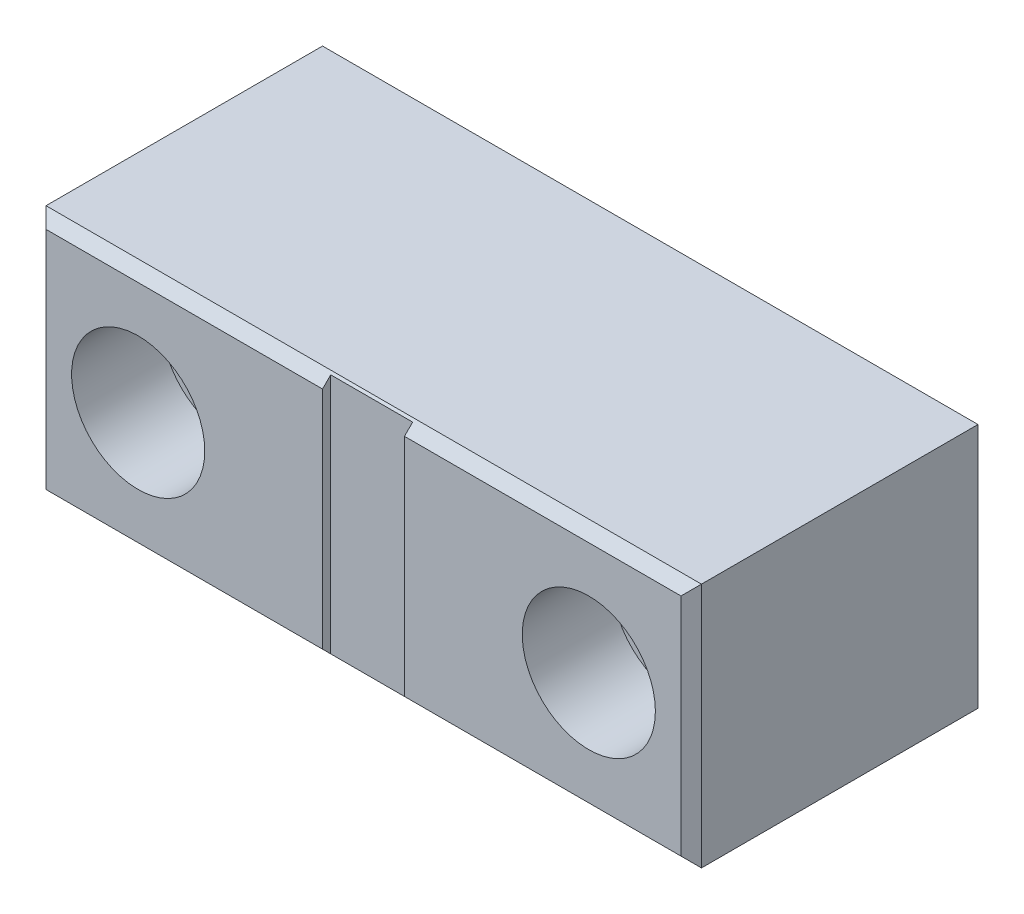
from build123d import *

# Parameters (mm, degrees)
SKETCH1_W                                        = 101.6
SKETCH1_H                                        = 38.1
BOSS_EXTRUDE1_DEPTH                              = 44.45
CBORE_FOR_1_2_SOCKET_HEAD_CAP_SCREW1_D           = 13.49248
CBORE_FOR_1_2_SOCKET_HEAD_CAP_SCREW1_CBORE_D     = 20.6375
CBORE_FOR_1_2_SOCKET_HEAD_CAP_SCREW1_CBORE_DEPTH = 13.97
CHAMFER1_SIZE                                    = 1.5875
SKETCH2_W                                        = 12.7
SKETCH2_H                                        = 38.1
CUT_EXTRUDE1_DEPTH                               = 1.27
CUT_EXTRUDE2_DEPTH                               = 0.127


with BuildPart() as part:
    # Sketch1 → Boss-Extrude1 (new body)
    with BuildSketch(Plane.XY.offset(-44.45)):
        with Locations((-838.2, -241.3)):
            Rectangle(SKETCH1_W, SKETCH1_H)
    extrude(amount=BOSS_EXTRUDE1_DEPTH)

    # CBORE for 1_2 Socket Head Cap Screw1 (through all)
    with Locations(Plane.XY):
        with Locations((-873.125, -241.3), (-803.275, -241.3)):
            CounterBoreHole(CBORE_FOR_1_2_SOCKET_HEAD_CAP_SCREW1_D / 2, CBORE_FOR_1_2_SOCKET_HEAD_CAP_SCREW1_CBORE_D / 2, CBORE_FOR_1_2_SOCKET_HEAD_CAP_SCREW1_CBORE_DEPTH)

    # Chamfer1
    chamfer1_edges = [part.edges().sort_by_distance(p)[0] for p in [
        (-787.4, -241.3, 0),
        (-838.2, -222.25, 0),
        (-889, -241.3, 0),
        (-838.2, -260.35, 0),
    ]]
    chamfer(chamfer1_edges, length=CHAMFER1_SIZE)

    # Sketch2 → Cut-Extrude1 (cut)
    with BuildSketch(Plane.XY):
        with Locations((-838.2, -241.3)):
            Rectangle(SKETCH2_W, SKETCH2_H)
    extrude(amount=-CUT_EXTRUDE1_DEPTH, mode=Mode.SUBTRACT)

    # Sketch3 → Cut-Extrude2 (cut)
    # profile 1 of 4: a face of its own
    with BuildSketch(Plane.XZ.offset(260.35)):
        with BuildLine():
            add(Edge.make_bspline(
                [(-842.331570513, -17.463772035), (-842.331272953, -17.412883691), (-842.33069494, -17.314032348), (-842.32426473, -17.169991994), (-842.313582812, -17.034863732), (-842.29894391, -16.908641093), (-842.281129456, -16.791291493), (-842.257348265, -16.683128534), (-842.230303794, -16.583651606), (-842.198959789, -16.492536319), (-842.163592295, -16.408555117), (-842.125098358, -16.330155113), (-842.081950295, -16.257454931), (-842.036614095, -16.189294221), (-841.987254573, -16.126788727), (-841.935276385, -16.06905574), (-841.878650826, -16.017429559), (-841.819302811, -15.970397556), (-841.756695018, -15.929168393), (-841.692612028, -15.89285298), (-841.626612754, -15.861828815), (-841.558517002, -15.837435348), (-841.488936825, -15.817286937), (-841.417628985, -15.803508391), (-841.344475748, -15.79483891), (-841.295098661, -15.794010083), (-841.270057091, -15.793589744)],
                knots=[0, 0, 0, 0, 1.646270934, 3.197905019, 4.663502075, 6.030701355, 7.308322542, 8.50163776, 9.611534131, 10.641858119, 11.616356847, 12.558055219, 13.465016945, 14.349605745, 15.204443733, 16.039544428, 16.859896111, 17.680448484, 18.487036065, 19.28249412, 20.06191084, 20.843045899, 21.620316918, 22.403196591, 23.190181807, 24, 24, 24, 24], degree=3))
            add(Edge.make_bspline(
                [(-841.270057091, -15.793589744), (-841.244806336, -15.794032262), (-841.194590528, -15.794912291), (-841.120349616, -15.803370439), (-841.047823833, -15.817404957), (-840.977322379, -15.837290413), (-840.908266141, -15.861960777), (-840.841195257, -15.892882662), (-840.775693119, -15.928877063), (-840.712800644, -15.97117158), (-840.651827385, -16.018326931), (-840.594271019, -16.071633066), (-840.540126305, -16.13055174), (-840.488713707, -16.194452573), (-840.441491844, -16.264561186), (-840.396521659, -16.3396582), (-840.356269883, -16.421056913), (-840.317503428, -16.507399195), (-840.284041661, -16.601074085), (-840.253864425, -16.701553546), (-840.22948136, -16.810024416), (-840.209171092, -16.925917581), (-840.193436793, -17.049658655), (-840.181977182, -17.180982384), (-840.175923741, -17.319975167), (-840.174783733, -17.415005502), (-840.174198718, -17.463772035)],
                knots=[0, 0, 0, 0, 0.810914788, 1.612654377, 2.396697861, 3.181598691, 3.963628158, 4.749916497, 5.551656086, 6.361998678, 7.18212741, 8.025565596, 8.878627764, 9.750805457, 10.657531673, 11.591944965, 12.560506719, 13.57287815, 14.630710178, 15.753379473, 16.941251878, 18.199788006, 19.531962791, 20.947069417, 22.433333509, 24, 24, 24, 24], degree=3))
            add(Edge.make_bspline(
                [(-840.174198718, -17.463772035), (-840.174789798, -17.512325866), (-840.175941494, -17.606931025), (-840.181909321, -17.74529841), (-840.193664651, -17.875925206), (-840.208369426, -17.999124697), (-840.228735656, -18.114384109), (-840.253777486, -18.222102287), (-840.281581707, -18.322744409), (-840.31590327, -18.415485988), (-840.353468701, -18.501620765), (-840.3943402, -18.582054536), (-840.438127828, -18.657498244), (-840.485833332, -18.727348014), (-840.536681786, -18.792098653), (-840.591761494, -18.850607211), (-840.649519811, -18.904283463), (-840.710672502, -18.952046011), (-840.774545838, -18.993851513), (-840.839823, -19.031238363), (-840.907662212, -19.061385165), (-840.976526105, -19.087270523), (-841.047399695, -19.107046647), (-841.120194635, -19.120720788), (-841.194540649, -19.130310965), (-841.244797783, -19.131042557), (-841.270057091, -19.131410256)],
                knots=[0, 0, 0, 0, 1.561518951, 3.042555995, 4.452378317, 5.7783523, 7.031515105, 8.214008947, 9.334062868, 10.386615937, 11.391082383, 12.354592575, 13.286541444, 14.194233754, 15.072674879, 15.931287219, 16.775624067, 17.606195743, 18.42308326, 19.229000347, 20.022332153, 20.807536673, 21.593273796, 22.3848459, 23.188221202, 24, 24, 24, 24], degree=3))
            add(Edge.make_bspline(
                [(-841.270057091, -19.131410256), (-841.295097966, -19.130987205), (-841.344473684, -19.130153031), (-841.417636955, -19.121522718), (-841.488650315, -19.107647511), (-841.557864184, -19.088219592), (-841.625633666, -19.06443899), (-841.691035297, -19.03345672), (-841.754796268, -18.997775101), (-841.816746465, -18.957139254), (-841.875721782, -18.910583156), (-841.932054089, -18.859089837), (-841.984328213, -18.801374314), (-842.032982, -18.738347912), (-842.07922278, -18.670590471), (-842.12175814, -18.597176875), (-842.1611017, -18.518398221), (-842.19706401, -18.433745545), (-842.228948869, -18.341983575), (-842.257113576, -18.242062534), (-842.279351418, -18.133100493), (-842.298385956, -18.015972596), (-842.31373879, -17.89017553), (-842.324220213, -17.755641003), (-842.330698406, -17.612452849), (-842.331274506, -17.514236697), (-842.331570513, -17.463772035)],
                knots=[0, 0, 0, 0, 0.810891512, 1.598919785, 2.382837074, 3.152667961, 3.926044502, 4.706494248, 5.493654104, 6.291793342, 7.103789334, 7.925228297, 8.761435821, 9.622817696, 10.50288917, 11.416980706, 12.369136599, 13.353924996, 14.394355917, 15.514179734, 16.714354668, 17.994756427, 19.357759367, 20.818452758, 22.365282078, 24, 24, 24, 24], degree=3))
        make_face()
        with BuildLine():
            add(Edge.make_bspline(
                [(-842.046634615, -17.4625), (-842.04652626, -17.504907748), (-842.046315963, -17.58721286), (-842.040822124, -17.706813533), (-842.033337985, -17.818365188), (-842.023684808, -17.922009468), (-842.009349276, -18.01739555), (-841.99328669, -18.105179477), (-841.973739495, -18.184896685), (-841.950611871, -18.257094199), (-841.924269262, -18.322997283), (-841.895507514, -18.384321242), (-841.864609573, -18.441790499), (-841.830030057, -18.494888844), (-841.792369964, -18.543789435), (-841.752479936, -18.58935779), (-841.708871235, -18.629995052), (-841.64854284, -18.678732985), (-841.568898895, -18.72909677), (-841.46855034, -18.77295358), (-841.365436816, -18.800514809), (-841.295449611, -18.804019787), (-841.260516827, -18.805769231)],
                knots=[0, 0, 0, 0, 1.459021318, 2.831673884, 4.118529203, 5.306027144, 6.411944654, 7.436330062, 8.375795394, 9.233974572, 10.042671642, 10.816086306, 11.563610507, 12.285937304, 12.993564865, 13.685989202, 14.367179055, 15.041617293, 16.353048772, 17.594441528, 18.799311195, 20, 20, 20, 20], degree=3))
            add(Edge.make_bspline(
                [(-841.260516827, -18.805769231), (-841.225358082, -18.804319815), (-841.155113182, -18.801423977), (-841.052484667, -18.773485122), (-840.952852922, -18.731330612), (-840.874773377, -18.681485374), (-840.815371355, -18.634016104), (-840.772810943, -18.593544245), (-840.733747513, -18.548227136), (-840.696697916, -18.499332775), (-840.662717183, -18.445927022), (-840.631817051, -18.388266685), (-840.603620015, -18.326191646), (-840.58755538, -18.282857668), (-840.579341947, -18.260702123)],
                knots=[0, 0, 0, 0, 1.353760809, 2.704726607, 4.075137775, 5.516104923, 6.260822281, 7.007110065, 7.778089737, 8.566572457, 9.372053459, 10.217411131, 11.088608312, 12, 12, 12, 12], degree=3))
            add(Edge.make_bspline(
                [(-840.579341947, -18.260702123), (-840.569769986, -18.232372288), (-840.550334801, -18.174850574), (-840.525286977, -18.085620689), (-840.505560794, -17.992001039), (-840.487814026, -17.894551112), (-840.475700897, -17.79255224), (-840.465951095, -17.68632002), (-840.460208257, -17.575774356), (-840.459496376, -17.500667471), (-840.459134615, -17.4625)],
                knots=[0, 0, 0, 0, 0.884706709, 1.796334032, 2.740027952, 3.714592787, 4.726048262, 5.777819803, 6.87074269, 8, 8, 8, 8], degree=3))
            add(Edge.make_bspline(
                [(-840.459134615, -17.4625), (-840.459633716, -17.424338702), (-840.460610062, -17.349687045), (-840.464342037, -17.240359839), (-840.473979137, -17.136521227), (-840.484682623, -17.03772387), (-840.500464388, -16.944514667), (-840.517480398, -16.856113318), (-840.540341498, -16.773615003), (-840.56476158, -16.695728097), (-840.59271101, -16.623337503), (-840.623477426, -16.556105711), (-840.656335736, -16.493708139), (-840.692024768, -16.436315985), (-840.730120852, -16.383672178), (-840.771629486, -16.336832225), (-840.814904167, -16.294344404), (-840.8755169, -16.245846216), (-840.954868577, -16.196396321), (-841.053607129, -16.15088881), (-841.156359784, -16.124755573), (-841.225822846, -16.121071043), (-841.260516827, -16.119230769)],
                knots=[0, 0, 0, 0, 1.31362396, 2.569729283, 3.763502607, 4.902122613, 5.988968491, 7.01645872, 7.998833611, 8.933434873, 9.825090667, 10.667526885, 11.477055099, 12.250526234, 12.991942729, 13.710640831, 14.402115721, 15.076753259, 16.378508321, 17.609869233, 18.806226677, 20, 20, 20, 20], degree=3))
            add(Edge.make_bspline(
                [(-841.260516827, -16.119230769), (-841.295632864, -16.121073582), (-841.365928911, -16.124762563), (-841.469749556, -16.150791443), (-841.569267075, -16.196160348), (-841.648408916, -16.24601), (-841.709063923, -16.293488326), (-841.751774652, -16.334660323), (-841.791821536, -16.379696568), (-841.82871295, -16.429046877), (-841.863265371, -16.482083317), (-841.894998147, -16.539223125), (-841.923588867, -16.600755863), (-841.949972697, -16.666629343), (-841.973170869, -16.738820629), (-841.992306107, -16.818439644), (-842.009983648, -16.905944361), (-842.022497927, -17.001847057), (-842.033622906, -17.105517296), (-842.040772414, -17.217347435), (-842.046334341, -17.337148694), (-842.046532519, -17.419879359), (-842.046634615, -17.4625)],
                knots=[0, 0, 0, 0, 1.207732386, 2.417664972, 3.655092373, 4.956220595, 5.625982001, 6.301752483, 6.994047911, 7.697131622, 8.419323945, 9.170223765, 9.943494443, 10.752040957, 11.610060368, 12.549350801, 13.567764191, 14.679664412, 15.874934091, 17.154273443, 18.533957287, 20, 20, 20, 20], degree=3))
        make_face(mode=Mode.SUBTRACT)
    # profile 2 of 4: a face of its own
    with BuildSketch(Plane.XZ.offset(260.35)):
        with BuildLine():
            add(Edge.make_bspline(
                [(-839.380448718, -18.561538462), (-839.362768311, -18.562589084), (-839.328107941, -18.564648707), (-839.27799816, -18.578778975), (-839.232645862, -18.603869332), (-839.192248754, -18.637309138), (-839.158950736, -18.677854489), (-839.132966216, -18.722845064), (-839.118959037, -18.773374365), (-839.116914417, -18.808235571), (-839.115865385, -18.826121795)],
                knots=[0, 0, 0, 0, 1.020151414, 1.999887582, 2.974338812, 3.990962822, 5.007586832, 5.987933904, 6.967670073, 8, 8, 8, 8], degree=3))
            add(Edge.make_bspline(
                [(-839.115865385, -18.826121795), (-839.116949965, -18.843578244), (-839.119088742, -18.878002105), (-839.132934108, -18.928150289), (-839.159148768, -18.973168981), (-839.192019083, -19.014264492), (-839.232655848, -19.047775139), (-839.27810538, -19.07265203), (-839.327990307, -19.087794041), (-839.362748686, -19.089722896), (-839.380448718, -19.090705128)],
                knots=[0, 0, 0, 0, 1.009421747, 1.99056486, 2.972319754, 3.999869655, 5.017953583, 5.993804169, 6.978383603, 8, 8, 8, 8], degree=3))
            add(Edge.make_bspline(
                [(-839.380448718, -19.090705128), (-839.398161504, -19.089758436), (-839.432741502, -19.087910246), (-839.482440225, -19.072341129), (-839.528166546, -19.048008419), (-839.568795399, -19.014202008), (-839.601941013, -18.973380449), (-839.627001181, -18.927840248), (-839.642050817, -18.878145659), (-839.644030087, -18.843606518), (-839.645032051, -18.826121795)],
                knots=[0, 0, 0, 0, 1.022052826, 1.995314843, 2.982371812, 4.00089066, 5.028879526, 6.005146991, 6.990147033, 8, 8, 8, 8], degree=3))
            add(Edge.make_bspline(
                [(-839.645032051, -18.826121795), (-839.644068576, -18.808206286), (-839.642187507, -18.773228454), (-839.626969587, -18.723154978), (-839.602135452, -18.677645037), (-839.568566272, -18.637370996), (-839.528176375, -18.6036368), (-839.482550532, -18.579085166), (-839.432621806, -18.564534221), (-839.398141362, -18.562554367), (-839.380448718, -18.561538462)],
                knots=[0, 0, 0, 0, 1.032775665, 2.016367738, 2.991239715, 4.008302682, 5.025365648, 6.011011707, 6.979408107, 8, 8, 8, 8], degree=3))
        make_face()
    # profile 3 of 4: a face of its own
    with BuildSketch(Plane.XZ.offset(260.35)):
        with BuildLine():
            add(Edge.make_bspline(
                [(-838.708814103, -17.463772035), (-838.708516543, -17.412883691), (-838.70793853, -17.314032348), (-838.70150832, -17.169991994), (-838.690826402, -17.034863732), (-838.676187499, -16.908641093), (-838.658373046, -16.791291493), (-838.634591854, -16.683128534), (-838.607547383, -16.583651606), (-838.576203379, -16.492536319), (-838.540835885, -16.408555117), (-838.502341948, -16.330155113), (-838.459193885, -16.257454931), (-838.413857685, -16.189294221), (-838.364498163, -16.126788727), (-838.312519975, -16.06905574), (-838.255894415, -16.017429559), (-838.196546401, -15.970397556), (-838.133938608, -15.929168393), (-838.069855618, -15.89285298), (-838.003856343, -15.861828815), (-837.935760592, -15.837435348), (-837.866180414, -15.817286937), (-837.794872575, -15.803508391), (-837.721719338, -15.79483891), (-837.672342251, -15.794010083), (-837.647300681, -15.793589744)],
                knots=[0, 0, 0, 0, 1.646270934, 3.197905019, 4.663502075, 6.030701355, 7.308322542, 8.50163776, 9.611534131, 10.641858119, 11.616356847, 12.558055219, 13.465016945, 14.349605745, 15.204443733, 16.039544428, 16.859896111, 17.680448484, 18.487036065, 19.28249412, 20.06191084, 20.843045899, 21.620316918, 22.403196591, 23.190181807, 24, 24, 24, 24], degree=3))
            add(Edge.make_bspline(
                [(-837.647300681, -15.793589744), (-837.622049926, -15.794032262), (-837.571834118, -15.794912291), (-837.497593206, -15.803370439), (-837.425067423, -15.817404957), (-837.354565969, -15.837290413), (-837.285509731, -15.861960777), (-837.218438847, -15.892882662), (-837.152936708, -15.928877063), (-837.090044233, -15.97117158), (-837.029070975, -16.018326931), (-836.971514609, -16.071633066), (-836.917369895, -16.13055174), (-836.865957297, -16.194452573), (-836.818735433, -16.264561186), (-836.773765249, -16.3396582), (-836.733513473, -16.421056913), (-836.694747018, -16.507399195), (-836.661285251, -16.601074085), (-836.631108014, -16.701553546), (-836.60672495, -16.810024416), (-836.586414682, -16.925917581), (-836.570680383, -17.049658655), (-836.559220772, -17.180982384), (-836.553167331, -17.319975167), (-836.552027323, -17.415005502), (-836.551442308, -17.463772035)],
                knots=[0, 0, 0, 0, 0.810914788, 1.612654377, 2.396697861, 3.181598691, 3.963628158, 4.749916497, 5.551656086, 6.361998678, 7.18212741, 8.025565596, 8.878627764, 9.750805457, 10.657531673, 11.591944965, 12.560506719, 13.57287815, 14.630710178, 15.753379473, 16.941251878, 18.199788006, 19.531962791, 20.947069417, 22.433333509, 24, 24, 24, 24], degree=3))
            add(Edge.make_bspline(
                [(-836.551442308, -17.463772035), (-836.552033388, -17.512325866), (-836.553185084, -17.606931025), (-836.559152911, -17.74529841), (-836.57090824, -17.875925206), (-836.585613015, -17.999124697), (-836.605979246, -18.114384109), (-836.631021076, -18.222102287), (-836.658825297, -18.322744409), (-836.69314686, -18.415485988), (-836.73071229, -18.501620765), (-836.77158379, -18.582054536), (-836.815371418, -18.657498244), (-836.863076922, -18.727348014), (-836.913925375, -18.792098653), (-836.969005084, -18.850607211), (-837.0267634, -18.904283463), (-837.087916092, -18.952046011), (-837.151789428, -18.993851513), (-837.21706659, -19.031238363), (-837.284905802, -19.061385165), (-837.353769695, -19.087270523), (-837.424643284, -19.107046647), (-837.497438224, -19.120720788), (-837.571784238, -19.130310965), (-837.622041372, -19.131042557), (-837.647300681, -19.131410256)],
                knots=[0, 0, 0, 0, 1.561518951, 3.042555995, 4.452378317, 5.7783523, 7.031515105, 8.214008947, 9.334062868, 10.386615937, 11.391082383, 12.354592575, 13.286541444, 14.194233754, 15.072674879, 15.931287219, 16.775624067, 17.606195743, 18.42308326, 19.229000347, 20.022332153, 20.807536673, 21.593273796, 22.3848459, 23.188221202, 24, 24, 24, 24], degree=3))
            add(Edge.make_bspline(
                [(-837.647300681, -19.131410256), (-837.672341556, -19.130987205), (-837.721717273, -19.130153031), (-837.794880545, -19.121522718), (-837.865893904, -19.107647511), (-837.935107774, -19.088219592), (-838.002877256, -19.06443899), (-838.068278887, -19.03345672), (-838.132039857, -18.997775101), (-838.193990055, -18.957139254), (-838.252965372, -18.910583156), (-838.309297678, -18.859089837), (-838.361571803, -18.801374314), (-838.41022559, -18.738347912), (-838.45646637, -18.670590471), (-838.49900173, -18.597176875), (-838.53834529, -18.518398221), (-838.5743076, -18.433745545), (-838.606192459, -18.341983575), (-838.634357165, -18.242062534), (-838.656595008, -18.133100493), (-838.675629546, -18.015972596), (-838.690982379, -17.89017553), (-838.701463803, -17.755641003), (-838.707941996, -17.612452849), (-838.708518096, -17.514236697), (-838.708814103, -17.463772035)],
                knots=[0, 0, 0, 0, 0.810891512, 1.598919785, 2.382837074, 3.152667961, 3.926044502, 4.706494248, 5.493654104, 6.291793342, 7.103789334, 7.925228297, 8.761435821, 9.622817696, 10.50288917, 11.416980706, 12.369136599, 13.353924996, 14.394355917, 15.514179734, 16.714354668, 17.994756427, 19.357759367, 20.818452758, 22.365282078, 24, 24, 24, 24], degree=3))
        make_face()
        with BuildLine():
            add(Edge.make_bspline(
                [(-838.423878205, -17.4625), (-838.42376985, -17.504907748), (-838.423559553, -17.58721286), (-838.418065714, -17.706813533), (-838.410581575, -17.818365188), (-838.400928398, -17.922009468), (-838.386592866, -18.01739555), (-838.37053028, -18.105179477), (-838.350983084, -18.184896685), (-838.327855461, -18.257094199), (-838.301512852, -18.322997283), (-838.272751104, -18.384321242), (-838.241853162, -18.441790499), (-838.207273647, -18.494888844), (-838.169613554, -18.543789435), (-838.129723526, -18.58935779), (-838.086114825, -18.629995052), (-838.02578643, -18.678732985), (-837.946142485, -18.72909677), (-837.845793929, -18.77295358), (-837.742680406, -18.800514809), (-837.6726932, -18.804019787), (-837.637760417, -18.805769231)],
                knots=[0, 0, 0, 0, 1.459021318, 2.831673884, 4.118529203, 5.306027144, 6.411944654, 7.436330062, 8.375795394, 9.233974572, 10.042671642, 10.816086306, 11.563610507, 12.285937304, 12.993564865, 13.685989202, 14.367179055, 15.041617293, 16.353048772, 17.594441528, 18.799311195, 20, 20, 20, 20], degree=3))
            add(Edge.make_bspline(
                [(-837.637760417, -18.805769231), (-837.602601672, -18.804319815), (-837.532356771, -18.801423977), (-837.429728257, -18.773485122), (-837.330096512, -18.731330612), (-837.252016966, -18.681485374), (-837.192614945, -18.634016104), (-837.150054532, -18.593544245), (-837.110991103, -18.548227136), (-837.073941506, -18.499332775), (-837.039960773, -18.445927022), (-837.009060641, -18.388266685), (-836.980863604, -18.326191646), (-836.96479897, -18.282857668), (-836.956585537, -18.260702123)],
                knots=[0, 0, 0, 0, 1.353760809, 2.704726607, 4.075137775, 5.516104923, 6.260822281, 7.007110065, 7.778089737, 8.566572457, 9.372053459, 10.217411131, 11.088608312, 12, 12, 12, 12], degree=3))
            add(Edge.make_bspline(
                [(-836.956585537, -18.260702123), (-836.947013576, -18.232372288), (-836.927578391, -18.174850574), (-836.902530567, -18.085620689), (-836.882804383, -17.992001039), (-836.865057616, -17.894551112), (-836.852944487, -17.79255224), (-836.843194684, -17.68632002), (-836.837451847, -17.575774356), (-836.836739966, -17.500667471), (-836.836378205, -17.4625)],
                knots=[0, 0, 0, 0, 0.884706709, 1.796334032, 2.740027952, 3.714592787, 4.726048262, 5.777819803, 6.87074269, 8, 8, 8, 8], degree=3))
            add(Edge.make_bspline(
                [(-836.836378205, -17.4625), (-836.836877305, -17.424338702), (-836.837853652, -17.349687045), (-836.841585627, -17.240359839), (-836.851222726, -17.136521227), (-836.861926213, -17.03772387), (-836.877707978, -16.944514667), (-836.894723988, -16.856113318), (-836.917585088, -16.773615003), (-836.942005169, -16.695728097), (-836.9699546, -16.623337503), (-837.000721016, -16.556105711), (-837.033579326, -16.493708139), (-837.069268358, -16.436315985), (-837.107364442, -16.383672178), (-837.148873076, -16.336832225), (-837.192147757, -16.294344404), (-837.25276049, -16.245846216), (-837.332112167, -16.196396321), (-837.430850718, -16.15088881), (-837.533603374, -16.124755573), (-837.603066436, -16.121071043), (-837.637760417, -16.119230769)],
                knots=[0, 0, 0, 0, 1.31362396, 2.569729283, 3.763502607, 4.902122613, 5.988968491, 7.01645872, 7.998833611, 8.933434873, 9.825090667, 10.667526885, 11.477055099, 12.250526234, 12.991942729, 13.710640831, 14.402115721, 15.076753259, 16.378508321, 17.609869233, 18.806226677, 20, 20, 20, 20], degree=3))
            add(Edge.make_bspline(
                [(-837.637760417, -16.119230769), (-837.672876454, -16.121073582), (-837.743172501, -16.124762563), (-837.846993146, -16.150791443), (-837.946510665, -16.196160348), (-838.025652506, -16.24601), (-838.086307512, -16.293488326), (-838.129018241, -16.334660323), (-838.169065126, -16.379696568), (-838.20595654, -16.429046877), (-838.240508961, -16.482083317), (-838.272241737, -16.539223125), (-838.300832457, -16.600755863), (-838.327216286, -16.666629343), (-838.350414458, -16.738820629), (-838.369549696, -16.818439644), (-838.387227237, -16.905944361), (-838.399741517, -17.001847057), (-838.410866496, -17.105517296), (-838.418016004, -17.217347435), (-838.423577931, -17.337148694), (-838.423776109, -17.419879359), (-838.423878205, -17.4625)],
                knots=[0, 0, 0, 0, 1.207732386, 2.417664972, 3.655092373, 4.956220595, 5.625982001, 6.301752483, 6.994047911, 7.697131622, 8.419323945, 9.170223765, 9.943494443, 10.752040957, 11.610060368, 12.549350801, 13.567764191, 14.679664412, 15.874934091, 17.154273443, 18.533957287, 20, 20, 20, 20], degree=3))
        make_face(mode=Mode.SUBTRACT)
    # profile 4 of 4: a face of its own
    with BuildSketch(Plane.XZ.offset(260.35)):
        with BuildLine():
            Line((-834.271955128, -15.875), (-834.271955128, -16.200641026))
            Line((-834.271955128, -16.200641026), (-835.351913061, -16.200641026))
            Line((-835.351913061, -16.200641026), (-835.523001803, -17.035732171))
            add(Edge.make_bspline(
                [(-835.523001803, -17.035732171), (-835.489386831, -17.026451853), (-835.42426314, -17.008472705), (-835.328142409, -16.988510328), (-835.23689091, -16.976476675), (-835.177676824, -16.974833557), (-835.149023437, -16.974038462)],
                knots=[0, 0, 0, 0, 1.100273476, 2.13160584, 3.095893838, 4, 4, 4, 4], degree=3))
            add(Edge.make_bspline(
                [(-835.149023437, -16.974038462), (-835.113568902, -16.974805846), (-835.043856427, -16.976314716), (-834.94185824, -16.990803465), (-834.844491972, -17.013608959), (-834.751961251, -17.045468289), (-834.664094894, -17.086207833), (-834.581701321, -17.137098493), (-834.503543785, -17.196546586), (-834.431024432, -17.264895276), (-834.365234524, -17.340117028), (-834.307389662, -17.420995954), (-834.258256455, -17.506746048), (-834.218740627, -17.5981866), (-834.187186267, -17.694306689), (-834.1661841, -17.796117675), (-834.152198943, -17.902659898), (-834.150636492, -17.975507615), (-834.149839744, -18.012655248)],
                knots=[0, 0, 0, 0, 1.052922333, 2.070308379, 3.05430497, 4.020497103, 4.973039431, 5.925935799, 6.892292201, 7.88610001, 8.88166317, 9.857072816, 10.836096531, 11.812156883, 12.81219415, 13.836441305, 14.89672472, 16, 16, 16, 16], degree=3))
            add(Edge.make_bspline(
                [(-834.149839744, -18.012655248), (-834.150443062, -18.038528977), (-834.151641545, -18.089926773), (-834.157736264, -18.166257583), (-834.169470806, -18.240972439), (-834.185225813, -18.314081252), (-834.205675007, -18.385445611), (-834.230430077, -18.455269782), (-834.260725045, -18.523119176), (-834.293954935, -18.589635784), (-834.331371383, -18.653315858), (-834.372899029, -18.712868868), (-834.416773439, -18.76918818), (-834.46398241, -18.821669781), (-834.514964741, -18.869968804), (-834.569102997, -18.914371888), (-834.625965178, -18.955629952), (-834.686431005, -18.992068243), (-834.749153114, -19.025598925), (-834.815037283, -19.053106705), (-834.882583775, -19.077699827), (-834.95276477, -19.097302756), (-835.0254213, -19.112663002), (-835.100673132, -19.123095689), (-835.178125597, -19.130694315), (-835.230626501, -19.131169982), (-835.257146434, -19.131410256)],
                knots=[0, 0, 0, 0, 1.056347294, 2.098418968, 3.122841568, 4.141288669, 5.149314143, 6.15115421, 7.162517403, 8.180376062, 9.185164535, 10.17417709, 11.141909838, 12.097768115, 13.052685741, 14.0056014, 14.954263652, 15.917497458, 16.885230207, 17.854509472, 18.828990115, 19.81800267, 20.826176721, 21.857883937, 22.917946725, 24, 24, 24, 24], degree=3))
            add(Edge.make_bspline(
                [(-835.257146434, -19.131410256), (-835.288782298, -19.130783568), (-835.351022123, -19.129550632), (-835.442208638, -19.116652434), (-835.529942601, -19.098179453), (-835.613517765, -19.07038798), (-835.693683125, -19.035565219), (-835.769359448, -18.991554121), (-835.842480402, -18.94168022), (-835.910073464, -18.882824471), (-835.972807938, -18.818493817), (-836.028965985, -18.748682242), (-836.078980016, -18.674541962), (-836.122049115, -18.595712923), (-836.158786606, -18.512402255), (-836.187647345, -18.424297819), (-836.210941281, -18.331859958), (-836.220795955, -18.268220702), (-836.225801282, -18.235897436)],
                knots=[0, 0, 0, 0, 1.0467383, 2.05933395, 3.04377827, 4.011590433, 4.970194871, 5.932262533, 6.905835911, 7.896367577, 8.894135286, 9.877477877, 10.858688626, 11.851381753, 12.8477658, 13.868841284, 14.917554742, 16, 16, 16, 16], degree=3))
            Line((-836.225801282, -18.235897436), (-835.940865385, -18.235897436))
            add(Edge.make_bspline(
                [(-835.940865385, -18.235897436), (-835.933854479, -18.266174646), (-835.920379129, -18.324369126), (-835.890801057, -18.406131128), (-835.854637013, -18.478992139), (-835.811634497, -18.543915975), (-835.760335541, -18.600529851), (-835.70179813, -18.650982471), (-835.63616841, -18.696498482), (-835.563240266, -18.734437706), (-835.486302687, -18.766794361), (-835.405778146, -18.788340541), (-835.323859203, -18.803490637), (-835.268452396, -18.805007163), (-835.240609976, -18.805769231)],
                knots=[0, 0, 0, 0, 1.136247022, 2.183929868, 3.172523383, 4.106158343, 5.02341133, 5.958108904, 6.928429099, 7.938127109, 8.96079061, 9.975095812, 10.982467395, 12, 12, 12, 12], degree=3))
            add(Edge.make_bspline(
                [(-835.240609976, -18.805769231), (-835.213433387, -18.805024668), (-835.159922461, -18.803558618), (-835.081172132, -18.792274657), (-835.005141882, -18.774896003), (-834.932581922, -18.748888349), (-834.862222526, -18.717279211), (-834.795843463, -18.67671625), (-834.731524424, -18.630034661), (-834.671264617, -18.576552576), (-834.616074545, -18.517615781), (-834.567310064, -18.45458986), (-834.526691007, -18.387355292), (-834.49246078, -18.317076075), (-834.466468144, -18.242981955), (-834.447925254, -18.165420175), (-834.437036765, -18.084199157), (-834.435538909, -18.028800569), (-834.434775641, -18.000570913)],
                knots=[0, 0, 0, 0, 1.027316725, 2.022795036, 3.002884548, 3.971462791, 4.93288096, 5.914575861, 6.907176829, 7.935150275, 8.956128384, 9.956726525, 10.942570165, 11.921478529, 12.907843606, 13.90538589, 14.932640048, 16, 16, 16, 16], degree=3))
            add(Edge.make_bspline(
                [(-834.434775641, -18.000570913), (-834.435372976, -17.975102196), (-834.436542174, -17.925250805), (-834.446094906, -17.852317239), (-834.462711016, -17.783308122), (-834.485774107, -17.71789021), (-834.515056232, -17.656001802), (-834.550839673, -17.597579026), (-834.59379597, -17.543391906), (-834.64286504, -17.493415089), (-834.696620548, -17.447291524), (-834.755987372, -17.407972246), (-834.819723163, -17.374894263), (-834.887060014, -17.346348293), (-834.9595996, -17.325846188), (-835.035905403, -17.310453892), (-835.116801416, -17.301549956), (-835.17211054, -17.300314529), (-835.200540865, -17.299679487)],
                knots=[0, 0, 0, 0, 1.045622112, 2.046656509, 3.013763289, 3.955457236, 4.890082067, 5.820317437, 6.762574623, 7.722996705, 8.69280354, 9.665887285, 10.63943826, 11.638615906, 12.663482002, 13.728887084, 14.832589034, 16, 16, 16, 16], degree=3))
            add(Edge.make_bspline(
                [(-835.200540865, -17.299679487), (-835.225150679, -17.300206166), (-835.275963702, -17.301293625), (-835.35390798, -17.309300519), (-835.435815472, -17.322217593), (-835.521372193, -17.339985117), (-835.610835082, -17.363236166), (-835.704015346, -17.391098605), (-835.801108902, -17.424410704), (-835.86652998, -17.449567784), (-835.900160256, -17.4625)],
                knots=[0, 0, 0, 0, 0.817624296, 1.688186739, 2.600797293, 3.572016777, 4.590301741, 5.671205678, 6.80286297, 8, 8, 8, 8], degree=3))
            Line((-835.900160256, -17.4625), (-835.574519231, -15.875))
            Line((-835.574519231, -15.875), (-834.271955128, -15.875))
        make_face()
    extrude(amount=-CUT_EXTRUDE2_DEPTH, mode=Mode.SUBTRACT)


solid = part.part
